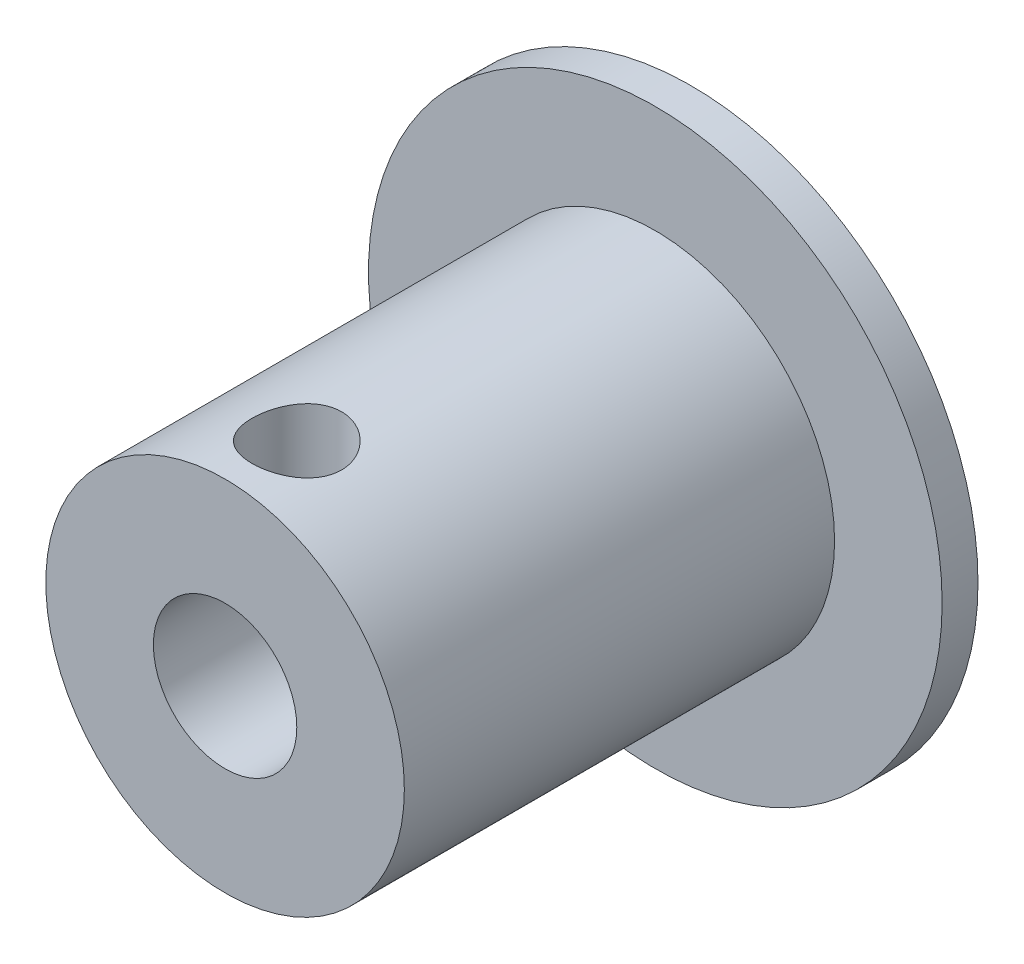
ISO-10303-21;
HEADER;
FILE_DESCRIPTION(('STEP AP214'),'2;1');
FILE_NAME('part.step','',(''),(''),'','','');
FILE_SCHEMA(('AUTOMOTIVE_DESIGN { 1 0 10303 214 1 1 1 1 }'));
ENDSEC;
DATA;
#1=APPLICATION_CONTEXT('core data for automotive mechanical design processes');
#2=APPLICATION_PROTOCOL_DEFINITION('international standard','automotive_design',2000,#1);
#3=PRODUCT_CONTEXT('',#1,'mechanical');
#4=PRODUCT('Part','Part','',(#3));
#5=PRODUCT_RELATED_PRODUCT_CATEGORY('part','',(#4));
#6=PRODUCT_DEFINITION_FORMATION('','',#4);
#7=PRODUCT_DEFINITION_CONTEXT('part definition',#1,'design');
#8=PRODUCT_DEFINITION('design','',#6,#7);
#9=PRODUCT_DEFINITION_SHAPE('','',#8);
#10=(LENGTH_UNIT() NAMED_UNIT(*) SI_UNIT(.MILLI.,.METRE.));
#11=(NAMED_UNIT(*) PLANE_ANGLE_UNIT() SI_UNIT($,.RADIAN.));
#12=(NAMED_UNIT(*) SI_UNIT($,.STERADIAN.) SOLID_ANGLE_UNIT());
#13=UNCERTAINTY_MEASURE_WITH_UNIT(LENGTH_MEASURE(1.E-05),#10,'distance_accuracy_value','');
#14=(GEOMETRIC_REPRESENTATION_CONTEXT(3) GLOBAL_UNCERTAINTY_ASSIGNED_CONTEXT((#13)) GLOBAL_UNIT_ASSIGNED_CONTEXT((#10,
#11,#12)) REPRESENTATION_CONTEXT('',''));
#15=CARTESIAN_POINT('',(0.,0.,0.));
#16=DIRECTION('',(0.,0.,1.));
#17=DIRECTION('',(1.,0.,0.));
#18=AXIS2_PLACEMENT_3D('',#15,#16,#17);
#19=CARTESIAN_POINT('',(0.,0.,1.));
#20=DIRECTION('',(0.,0.,-1.));
#21=DIRECTION('',(-1.,0.,0.));
#22=AXIS2_PLACEMENT_3D('',#19,#20,#21);
#23=CYLINDRICAL_SURFACE('',#22,8.);
#24=CARTESIAN_POINT('',(0.,0.,1.));
#25=DIRECTION('',(0.,0.,1.));
#26=DIRECTION('',(1.,0.,0.));
#27=AXIS2_PLACEMENT_3D('',#24,#25,#26);
#28=CIRCLE('',#27,8.);
#29=CARTESIAN_POINT('',(8.,0.,1.));
#30=VERTEX_POINT('',#29);
#31=EDGE_CURVE('E10',#30,#30,#28,.T.);
#32=ORIENTED_EDGE('',*,*,#31,.F.);
#33=EDGE_LOOP('',(#32));
#34=FACE_BOUND('',#33,.T.);
#35=CARTESIAN_POINT('',(0.,0.,0.));
#36=DIRECTION('',(0.,0.,1.));
#37=DIRECTION('',(1.,0.,0.));
#38=AXIS2_PLACEMENT_3D('',#35,#36,#37);
#39=CIRCLE('',#38,8.);
#40=CARTESIAN_POINT('',(8.,0.,0.));
#41=VERTEX_POINT('',#40);
#42=EDGE_CURVE('E37',#41,#41,#39,.T.);
#43=ORIENTED_EDGE('',*,*,#42,.T.);
#44=EDGE_LOOP('',(#43));
#45=FACE_BOUND('',#44,.T.);
#46=ADVANCED_FACE('F34',(#34,#45),#23,.T.);
#47=CARTESIAN_POINT('',(0.,0.,1.));
#48=DIRECTION('',(0.,0.,1.));
#49=DIRECTION('',(1.,0.,0.));
#50=AXIS2_PLACEMENT_3D('',#47,#48,#49);
#51=PLANE('',#50);
#52=CARTESIAN_POINT('',(0.,0.,1.));
#53=DIRECTION('',(0.,0.,1.));
#54=DIRECTION('',(1.,0.,0.));
#55=AXIS2_PLACEMENT_3D('',#52,#53,#54);
#56=CIRCLE('',#55,5.);
#57=CARTESIAN_POINT('',(5.,0.,1.));
#58=VERTEX_POINT('',#57);
#59=EDGE_CURVE('E46',#58,#58,#56,.T.);
#60=ORIENTED_EDGE('',*,*,#59,.F.);
#61=EDGE_LOOP('',(#60));
#62=FACE_BOUND('',#61,.T.);
#63=ORIENTED_EDGE('',*,*,#31,.T.);
#64=EDGE_LOOP('',(#63));
#65=FACE_BOUND('',#64,.T.);
#66=ADVANCED_FACE('F93',(#62,#65),#51,.T.);
#67=CARTESIAN_POINT('',(0.,0.,0.));
#68=DIRECTION('',(0.,0.,1.));
#69=DIRECTION('',(1.,0.,0.));
#70=AXIS2_PLACEMENT_3D('',#67,#68,#69);
#71=PLANE('',#70);
#72=CARTESIAN_POINT('',(0.,0.,0.));
#73=DIRECTION('',(0.,0.,-1.));
#74=DIRECTION('',(-1.,0.,0.));
#75=AXIS2_PLACEMENT_3D('',#72,#73,#74);
#76=CIRCLE('',#75,2.);
#77=CARTESIAN_POINT('',(-2.,0.,0.));
#78=VERTEX_POINT('',#77);
#79=EDGE_CURVE('E54',#78,#78,#76,.T.);
#80=ORIENTED_EDGE('',*,*,#79,.F.);
#81=EDGE_LOOP('',(#80));
#82=FACE_BOUND('',#81,.T.);
#83=ORIENTED_EDGE('',*,*,#42,.F.);
#84=EDGE_LOOP('',(#83));
#85=FACE_BOUND('',#84,.T.);
#86=ADVANCED_FACE('F88',(#82,#85),#71,.F.);
#87=CARTESIAN_POINT('',(0.,0.,13.));
#88=DIRECTION('',(0.,0.,-1.));
#89=DIRECTION('',(-1.,0.,0.));
#90=AXIS2_PLACEMENT_3D('',#87,#88,#89);
#91=CYLINDRICAL_SURFACE('',#90,5.);
#92=CARTESIAN_POINT('',(0.,5.,12.25));
#93=CARTESIAN_POINT('',(-0.0690634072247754,4.99999883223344,12.2499980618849));
#94=CARTESIAN_POINT('',(-0.138148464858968,4.99855481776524,12.2442570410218));
#95=CARTESIAN_POINT('',(-0.274338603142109,4.99293428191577,12.2214790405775));
#96=CARTESIAN_POINT('',(-0.341442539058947,4.98875621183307,12.2044356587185));
#97=CARTESIAN_POINT('',(-0.471684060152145,4.97813021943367,12.1596339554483));
#98=CARTESIAN_POINT('',(-0.534826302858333,4.97168502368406,12.1318885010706));
#99=CARTESIAN_POINT('',(-0.655560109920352,4.95721119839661,12.066515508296));
#100=CARTESIAN_POINT('',(-0.713151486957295,4.94918251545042,12.0288876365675));
#101=CARTESIAN_POINT('',(-0.822334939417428,4.93222844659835,11.9439993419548));
#102=CARTESIAN_POINT('',(-0.87379640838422,4.92328922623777,11.896573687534));
#103=CARTESIAN_POINT('',(-0.968124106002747,4.90561350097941,11.7937898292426));
#104=CARTESIAN_POINT('',(-1.01098936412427,4.89687701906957,11.7384307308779));
#105=CARTESIAN_POINT('',(-1.08752211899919,4.88045646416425,11.6203373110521));
#106=CARTESIAN_POINT('',(-1.12104351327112,4.87278995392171,11.5575056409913));
#107=CARTESIAN_POINT('',(-1.1769974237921,4.85957912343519,11.426876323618));
#108=CARTESIAN_POINT('',(-1.1994317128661,4.85403446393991,11.3590794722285));
#109=CARTESIAN_POINT('',(-1.23212903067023,4.84583730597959,11.2218804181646));
#110=CARTESIAN_POINT('',(-1.24262689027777,4.84312909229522,11.1525375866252));
#111=CARTESIAN_POINT('',(-1.25188481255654,4.84074468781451,11.0130261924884));
#112=CARTESIAN_POINT('',(-1.25064678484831,4.8410680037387,10.9428577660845));
#113=CARTESIAN_POINT('',(-1.23665543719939,4.84466004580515,10.8054868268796));
#114=CARTESIAN_POINT('',(-1.22418195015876,4.84785719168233,10.7382536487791));
#115=CARTESIAN_POINT('',(-1.18852015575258,4.85672258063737,10.6068657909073));
#116=CARTESIAN_POINT('',(-1.16533108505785,4.8623909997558,10.5427113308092));
#117=CARTESIAN_POINT('',(-1.10865789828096,4.87562594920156,10.4185516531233));
#118=CARTESIAN_POINT('',(-1.07507222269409,4.88321106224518,10.358594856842));
#119=CARTESIAN_POINT('',(-0.998630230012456,4.89941425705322,10.2450677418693));
#120=CARTESIAN_POINT('',(-0.955772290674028,4.90803251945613,10.1914985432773));
#121=CARTESIAN_POINT('',(-0.860552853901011,4.92563233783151,10.090663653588));
#122=CARTESIAN_POINT('',(-0.807955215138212,4.93461724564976,10.0436212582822));
#123=CARTESIAN_POINT('',(-0.69550993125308,4.95171637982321,9.95898229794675));
#124=CARTESIAN_POINT('',(-0.635662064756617,4.95983057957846,9.92138602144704));
#125=CARTESIAN_POINT('',(-0.510096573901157,4.97431443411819,9.85662451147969));
#126=CARTESIAN_POINT('',(-0.444359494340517,4.98067800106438,9.82949554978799));
#127=CARTESIAN_POINT('',(-0.309063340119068,4.99089930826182,9.78673557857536));
#128=CARTESIAN_POINT('',(-0.23950499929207,4.99475752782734,9.77110236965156));
#129=CARTESIAN_POINT('',(-0.100449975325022,4.99946249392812,9.75211869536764));
#130=CARTESIAN_POINT('',(-0.0309972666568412,5.00038377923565,9.74846414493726));
#131=CARTESIAN_POINT('',(0.107527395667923,4.99932337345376,9.75270750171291));
#132=CARTESIAN_POINT('',(0.176599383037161,4.99734194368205,9.76060436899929));
#133=CARTESIAN_POINT('',(0.311345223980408,4.99074650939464,9.78747575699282));
#134=CARTESIAN_POINT('',(0.377054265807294,4.98617195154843,9.80628438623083));
#135=CARTESIAN_POINT('',(0.504381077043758,4.97490588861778,9.85425590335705));
#136=CARTESIAN_POINT('',(0.565998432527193,4.9682141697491,9.88341983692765));
#137=CARTESIAN_POINT('',(0.684602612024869,4.95327756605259,9.95186344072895));
#138=CARTESIAN_POINT('',(0.741487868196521,4.94500722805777,9.99131342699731));
#139=CARTESIAN_POINT('',(0.847938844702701,4.92787090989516,10.0789915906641));
#140=CARTESIAN_POINT('',(0.897503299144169,4.91900482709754,10.1272212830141));
#141=CARTESIAN_POINT('',(0.98915880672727,4.90140797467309,10.2325016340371));
#142=CARTESIAN_POINT('',(1.03103655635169,4.89268586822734,10.289739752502));
#143=CARTESIAN_POINT('',(1.10459229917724,4.87660731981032,10.4106105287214));
#144=CARTESIAN_POINT('',(1.13627074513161,4.86925081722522,10.4742429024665));
#145=CARTESIAN_POINT('',(1.18829285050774,4.85681745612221,10.6057547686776));
#146=CARTESIAN_POINT('',(1.20870366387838,4.85172712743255,10.6736063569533));
#147=CARTESIAN_POINT('',(1.23778804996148,4.84438953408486,10.8119246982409));
#148=CARTESIAN_POINT('',(1.24646418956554,4.84214164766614,10.8823908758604));
#149=CARTESIAN_POINT('',(1.25169882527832,4.84079084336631,11.0217675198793));
#150=CARTESIAN_POINT('',(1.24859824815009,4.8415994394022,11.0906645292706));
#151=CARTESIAN_POINT('',(1.23114773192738,4.84606590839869,11.2269199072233));
#152=CARTESIAN_POINT('',(1.21679801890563,4.84972372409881,11.294278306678));
#153=CARTESIAN_POINT('',(1.17744276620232,4.85942717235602,11.4251737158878));
#154=CARTESIAN_POINT('',(1.15250117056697,4.86545846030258,11.4887310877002));
#155=CARTESIAN_POINT('',(1.09272076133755,4.87923129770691,11.6108044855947));
#156=CARTESIAN_POINT('',(1.05788057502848,4.88697308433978,11.6693198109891));
#157=CARTESIAN_POINT('',(0.978223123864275,4.90354695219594,11.7812955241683));
#158=CARTESIAN_POINT('',(0.933169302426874,4.91240220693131,11.8345842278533));
#159=CARTESIAN_POINT('',(0.834824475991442,4.93006689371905,11.9329558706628));
#160=CARTESIAN_POINT('',(0.781531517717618,4.93887631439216,11.9780368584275));
#161=CARTESIAN_POINT('',(0.667056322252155,4.95564713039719,12.0595094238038));
#162=CARTESIAN_POINT('',(0.605748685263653,4.9635902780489,12.0957288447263));
#163=CARTESIAN_POINT('',(0.477721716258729,4.97754104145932,12.1572895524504));
#164=CARTESIAN_POINT('',(0.411006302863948,4.98355004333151,12.1826386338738));
#165=CARTESIAN_POINT('',(0.287008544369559,4.99206716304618,12.2179765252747));
#166=CARTESIAN_POINT('',(0.230316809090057,4.99502154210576,12.2299593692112));
#167=CARTESIAN_POINT('',(0.115755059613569,4.9989883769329,12.2459716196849));
#168=CARTESIAN_POINT('',(0.0578851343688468,5.00000097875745,12.2500016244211));
#169=CARTESIAN_POINT('',(0.,5.,12.25));
#170=B_SPLINE_CURVE_WITH_KNOTS('',3,(#92,#93,#94,#95,#96,#97,#98,#99,#100,#101,#102,#103,#104,
#105,#106,#107,#108,#109,#110,#111,#112,#113,#114,#115,#116,#117,#118,#119,#120,#121,#122,#123,
#124,#125,#126,#127,#128,#129,#130,#131,#132,#133,#134,#135,#136,#137,#138,#139,#140,#141,#142,
#143,#144,#145,#146,#147,#148,#149,#150,#151,#152,#153,#154,#155,#156,#157,#158,#159,#160,#161,
#162,#163,#164,#165,#166,#167,#168,#169),.UNSPECIFIED.,.T.,.F.,(4,2,2,2,2,2,2,2,2,2,2,2,2,2,2,2,
2,2,2,2,2,2,2,2,2,2,2,2,2,2,2,2,2,2,2,2,2,2,4),(0.,0.206978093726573,0.414073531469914,
0.620920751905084,0.827774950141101,1.03845362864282,1.24915607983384,1.46298872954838,
1.67678717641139,1.88630245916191,2.09578365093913,2.30018747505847,2.50460586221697,
2.71108773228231,2.917605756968,3.13001250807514,3.3424257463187,3.55556857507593,
3.768670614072,3.97631924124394,4.1839491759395,4.38850228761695,4.59307606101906,
4.8012798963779,5.00951969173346,5.22287091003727,5.43621265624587,5.64826878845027,
5.86027852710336,6.0661981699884,6.27211367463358,6.47680333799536,6.6815214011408,
6.89157980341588,7.1016880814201,7.31560154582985,7.52936136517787,7.70285202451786,
7.87632963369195),.UNSPECIFIED.);
#171=CARTESIAN_POINT('',(0.,5.,12.25));
#172=VERTEX_POINT('',#171);
#173=EDGE_CURVE('E57',#172,#172,#170,.T.);
#174=ORIENTED_EDGE('',*,*,#173,.T.);
#175=EDGE_LOOP('',(#174));
#176=FACE_BOUND('',#175,.T.);
#177=CARTESIAN_POINT('',(0.,0.,13.));
#178=DIRECTION('',(0.,0.,1.));
#179=DIRECTION('',(1.,0.,0.));
#180=AXIS2_PLACEMENT_3D('',#177,#178,#179);
#181=CIRCLE('',#180,5.);
#182=CARTESIAN_POINT('',(5.,0.,13.));
#183=VERTEX_POINT('',#182);
#184=EDGE_CURVE('E44',#183,#183,#181,.T.);
#185=ORIENTED_EDGE('',*,*,#184,.F.);
#186=EDGE_LOOP('',(#185));
#187=FACE_BOUND('',#186,.T.);
#188=ORIENTED_EDGE('',*,*,#59,.T.);
#189=EDGE_LOOP('',(#188));
#190=FACE_BOUND('',#189,.T.);
#191=ADVANCED_FACE('F68',(#176,#187,#190),#91,.T.);
#192=CARTESIAN_POINT('',(0.,0.,13.));
#193=DIRECTION('',(0.,0.,1.));
#194=DIRECTION('',(1.,0.,0.));
#195=AXIS2_PLACEMENT_3D('',#192,#193,#194);
#196=PLANE('',#195);
#197=CARTESIAN_POINT('',(0.,0.,13.));
#198=DIRECTION('',(0.,0.,1.));
#199=DIRECTION('',(1.,0.,0.));
#200=AXIS2_PLACEMENT_3D('',#197,#198,#199);
#201=CIRCLE('',#200,2.);
#202=CARTESIAN_POINT('',(2.,0.,13.));
#203=VERTEX_POINT('',#202);
#204=EDGE_CURVE('E49',#203,#203,#201,.T.);
#205=ORIENTED_EDGE('',*,*,#204,.F.);
#206=EDGE_LOOP('',(#205));
#207=FACE_BOUND('',#206,.T.);
#208=ORIENTED_EDGE('',*,*,#184,.T.);
#209=EDGE_LOOP('',(#208));
#210=FACE_BOUND('',#209,.T.);
#211=ADVANCED_FACE('F81',(#207,#210),#196,.T.);
#212=CARTESIAN_POINT('',(0.,0.,0.));
#213=DIRECTION('',(0.,0.,-1.));
#214=DIRECTION('',(-1.,0.,0.));
#215=AXIS2_PLACEMENT_3D('',#212,#213,#214);
#216=CYLINDRICAL_SURFACE('',#215,2.);
#217=CARTESIAN_POINT('',(0.,2.,12.25));
#218=CARTESIAN_POINT('',(0.0635104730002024,1.99999595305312,12.2499956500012));
#219=CARTESIAN_POINT('',(0.127096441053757,1.99694323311,12.2451269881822));
#220=CARTESIAN_POINT('',(0.252318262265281,1.98502167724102,12.2259141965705));
#221=CARTESIAN_POINT('',(0.313950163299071,1.97614175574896,12.2115520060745));
#222=CARTESIAN_POINT('',(0.43320555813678,1.95345852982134,12.1741886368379));
#223=CARTESIAN_POINT('',(0.490847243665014,1.93967960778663,12.1512302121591));
#224=CARTESIAN_POINT('',(0.601260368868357,1.90834598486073,12.0976141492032));
#225=CARTESIAN_POINT('',(0.654032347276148,1.89079170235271,12.0669573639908));
#226=CARTESIAN_POINT('',(0.757974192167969,1.85170152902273,11.996113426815));
#227=CARTESIAN_POINT('',(0.808679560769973,1.82995962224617,11.9553607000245));
#228=CARTESIAN_POINT('',(0.902986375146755,1.78531349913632,11.8667808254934));
#229=CARTESIAN_POINT('',(0.946578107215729,1.76240774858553,11.8189441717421));
#230=CARTESIAN_POINT('',(1.03142873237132,1.71430418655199,11.7099661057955));
#231=CARTESIAN_POINT('',(1.0715720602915,1.68921610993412,11.6479002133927));
#232=CARTESIAN_POINT('',(1.14073966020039,1.64330198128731,11.5164351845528));
#233=CARTESIAN_POINT('',(1.16978270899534,1.62246875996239,11.4470486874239));
#234=CARTESIAN_POINT('',(1.2093340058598,1.59309575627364,11.3211894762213));
#235=CARTESIAN_POINT('',(1.22269552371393,1.58276905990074,11.2660331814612));
#236=CARTESIAN_POINT('',(1.24181843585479,1.56781357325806,11.1536940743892));
#237=CARTESIAN_POINT('',(1.24759056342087,1.56317673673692,11.0965142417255));
#238=CARTESIAN_POINT('',(1.25118918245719,1.56029885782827,10.9815869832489));
#239=CARTESIAN_POINT('',(1.2489948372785,1.56207458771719,10.9238384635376));
#240=CARTESIAN_POINT('',(1.23676317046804,1.5717740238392,10.809689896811));
#241=CARTESIAN_POINT('',(1.22671956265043,1.5797026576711,10.7532909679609));
#242=CARTESIAN_POINT('',(1.19968103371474,1.60032573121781,10.6445615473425));
#243=CARTESIAN_POINT('',(1.18285016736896,1.61290715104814,10.5921675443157));
#244=CARTESIAN_POINT('',(1.14290189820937,1.64145566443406,10.4908388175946));
#245=CARTESIAN_POINT('',(1.11978227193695,1.65742395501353,10.4419053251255));
#246=CARTESIAN_POINT('',(1.06294892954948,1.6945481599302,10.3391667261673));
#247=CARTESIAN_POINT('',(1.0280629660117,1.71611591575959,10.2861591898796));
#248=CARTESIAN_POINT('',(0.950881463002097,1.76005711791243,10.1861697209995));
#249=CARTESIAN_POINT('',(0.908578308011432,1.78243137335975,10.1391940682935));
#250=CARTESIAN_POINT('',(0.809519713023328,1.82979894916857,10.0446982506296));
#251=CARTESIAN_POINT('',(0.75153135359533,1.85461531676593,9.99836702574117));
#252=CARTESIAN_POINT('',(0.627148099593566,1.90028055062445,9.91614910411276));
#253=CARTESIAN_POINT('',(0.560756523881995,1.92113097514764,9.88025830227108));
#254=CARTESIAN_POINT('',(0.424883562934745,1.95553372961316,9.82223631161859));
#255=CARTESIAN_POINT('',(0.355763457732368,1.96941976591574,9.79946596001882));
#256=CARTESIAN_POINT('',(0.213612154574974,1.98984929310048,9.76623507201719));
#257=CARTESIAN_POINT('',(0.140586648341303,1.9964031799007,9.755757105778));
#258=CARTESIAN_POINT('',(0.00451561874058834,2.00097840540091,9.74843414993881));
#259=CARTESIAN_POINT('',(-0.0584027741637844,2.0001216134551,9.74979682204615));
#260=CARTESIAN_POINT('',(-0.182972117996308,1.99258901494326,9.76188282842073));
#261=CARTESIAN_POINT('',(-0.244623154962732,1.98591360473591,9.77260552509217));
#262=CARTESIAN_POINT('',(-0.362521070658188,1.96774052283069,9.80223853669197));
#263=CARTESIAN_POINT('',(-0.418885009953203,1.95644170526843,9.82081215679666));
#264=CARTESIAN_POINT('',(-0.527638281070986,1.92995684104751,9.86529638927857));
#265=CARTESIAN_POINT('',(-0.580026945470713,1.91477014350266,9.89120823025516));
#266=CARTESIAN_POINT('',(-0.685084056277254,1.87990012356,9.95251520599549));
#267=CARTESIAN_POINT('',(-0.737246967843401,1.85991764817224,9.98860356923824));
#268=CARTESIAN_POINT('',(-0.835142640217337,1.81806970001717,10.0677938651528));
#269=CARTESIAN_POINT('',(-0.88086815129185,1.79620214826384,10.1109035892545));
#270=CARTESIAN_POINT('',(-0.971474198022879,1.74905869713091,10.2101350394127));
#271=CARTESIAN_POINT('',(-1.01526851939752,1.72374883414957,10.2672372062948));
#272=CARTESIAN_POINT('',(-1.09280351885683,1.67566762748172,10.3888757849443));
#273=CARTESIAN_POINT('',(-1.12655115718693,1.65289453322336,10.453407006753));
#274=CARTESIAN_POINT('',(-1.17684772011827,1.61733530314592,10.5746921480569));
#275=CARTESIAN_POINT('',(-1.19551895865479,1.6034563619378,10.6302407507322));
#276=CARTESIAN_POINT('',(-1.22500108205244,1.58105030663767,10.7443931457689));
#277=CARTESIAN_POINT('',(-1.23582424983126,1.57251483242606,10.8029920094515));
#278=CARTESIAN_POINT('',(-1.24901383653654,1.56206324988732,10.9220902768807));
#279=CARTESIAN_POINT('',(-1.25133186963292,1.56018501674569,10.9825985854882));
#280=CARTESIAN_POINT('',(-1.24719778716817,1.56349063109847,11.103130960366));
#281=CARTESIAN_POINT('',(-1.24074275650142,1.56867682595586,11.1631548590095));
#282=CARTESIAN_POINT('',(-1.22038272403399,1.58455388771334,11.2760297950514));
#283=CARTESIAN_POINT('',(-1.20711919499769,1.5947680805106,11.3290693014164));
#284=CARTESIAN_POINT('',(-1.17417623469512,1.6191753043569,11.4321350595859));
#285=CARTESIAN_POINT('',(-1.15449412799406,1.63336999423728,11.4821600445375));
#286=CARTESIAN_POINT('',(-1.10602690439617,1.66663902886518,11.5855967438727));
#287=CARTESIAN_POINT('',(-1.07633644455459,1.68612230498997,11.6384502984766));
#288=CARTESIAN_POINT('',(-1.01000017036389,1.72667706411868,11.738938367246));
#289=CARTESIAN_POINT('',(-0.973348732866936,1.74774982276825,11.7865686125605));
#290=CARTESIAN_POINT('',(-0.885670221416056,1.79401910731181,11.8850142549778));
#291=CARTESIAN_POINT('',(-0.833233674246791,1.81920541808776,11.9345908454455));
#292=CARTESIAN_POINT('',(-0.7198224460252,1.86698729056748,12.0244948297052));
#293=CARTESIAN_POINT('',(-0.658842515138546,1.88958124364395,12.0648164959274));
#294=CARTESIAN_POINT('',(-0.529355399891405,1.92986710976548,12.1347711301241));
#295=CARTESIAN_POINT('',(-0.460835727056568,1.94755071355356,12.1643860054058));
#296=CARTESIAN_POINT('',(-0.318394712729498,1.97581521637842,12.2110718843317));
#297=CARTESIAN_POINT('',(-0.244493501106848,1.98642121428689,12.2281872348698));
#298=CARTESIAN_POINT('',(-0.141418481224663,1.99519472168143,12.2422992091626));
#299=CARTESIAN_POINT('',(-0.113248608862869,1.99699172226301,12.245181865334));
#300=CARTESIAN_POINT('',(-0.0567241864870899,1.99939530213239,12.2490332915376));
#301=CARTESIAN_POINT('',(-0.0283696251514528,2.0000018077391,12.25000194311));
#302=CARTESIAN_POINT('',(0.,2.,12.25));
#303=B_SPLINE_CURVE_WITH_KNOTS('',3,(#217,#218,#219,#220,#221,#222,#223,#224,#225,#226,#227,
#228,#229,#230,#231,#232,#233,#234,#235,#236,#237,#238,#239,#240,#241,#242,#243,#244,#245,#246,
#247,#248,#249,#250,#251,#252,#253,#254,#255,#256,#257,#258,#259,#260,#261,#262,#263,#264,#265,
#266,#267,#268,#269,#270,#271,#272,#273,#274,#275,#276,#277,#278,#279,#280,#281,#282,#283,#284,
#285,#286,#287,#288,#289,#290,#291,#292,#293,#294,#295,#296,#297,#298,#299,#300,#301,#302),
.UNSPECIFIED.,.T.,.F.,(4,2,2,2,2,2,2,2,2,2,2,2,2,2,2,2,2,2,2,2,2,2,2,2,2,2,2,2,2,2,2,2,2,2,2,2,
2,2,2,2,2,2,4),(0.,0.190412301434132,0.381187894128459,0.571026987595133,0.760845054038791,
0.965821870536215,1.17107628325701,1.40412975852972,1.63678724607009,1.80912008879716,
1.9812089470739,2.15374823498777,2.32642584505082,2.49515839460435,2.66395067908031,
2.86427450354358,3.0648052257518,3.2984218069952,3.53194640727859,3.75284174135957,
3.97342347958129,4.16127180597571,4.34910733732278,4.52959504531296,4.71011298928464,
4.9088523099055,5.10781368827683,5.3356570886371,5.56334227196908,5.74329940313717,
5.92297427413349,6.10366974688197,6.28442527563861,6.45063169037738,6.61690747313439,
6.80725523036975,6.99775741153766,7.22600539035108,7.45439424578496,7.68316725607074,
7.91112460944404,7.99617501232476,8.08123067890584),.UNSPECIFIED.);
#304=CARTESIAN_POINT('',(0.,2.,12.25));
#305=VERTEX_POINT('',#304);
#306=EDGE_CURVE('E64',#305,#305,#303,.T.);
#307=ORIENTED_EDGE('',*,*,#306,.T.);
#308=EDGE_LOOP('',(#307));
#309=FACE_BOUND('',#308,.T.);
#310=ORIENTED_EDGE('',*,*,#79,.T.);
#311=EDGE_LOOP('',(#310));
#312=FACE_BOUND('',#311,.T.);
#313=ORIENTED_EDGE('',*,*,#204,.T.);
#314=EDGE_LOOP('',(#313));
#315=FACE_BOUND('',#314,.T.);
#316=ADVANCED_FACE('F75',(#309,#312,#315),#216,.F.);
#317=CARTESIAN_POINT('',(0.,5.,11.));
#318=DIRECTION('',(0.,1.,0.));
#319=DIRECTION('',(0.,0.,1.));
#320=AXIS2_PLACEMENT_3D('',#317,#318,#319);
#321=CYLINDRICAL_SURFACE('',#320,1.24999999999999);
#322=ORIENTED_EDGE('',*,*,#306,.F.);
#323=EDGE_LOOP('',(#322));
#324=FACE_BOUND('',#323,.T.);
#325=ORIENTED_EDGE('',*,*,#173,.F.);
#326=EDGE_LOOP('',(#325));
#327=FACE_BOUND('',#326,.T.);
#328=ADVANCED_FACE('F72',(#324,#327),#321,.F.);
#329=CLOSED_SHELL('',(#46,#66,#86,#191,#211,#316,#328));
#330=MANIFOLD_SOLID_BREP('B2',#329);
#331=ADVANCED_BREP_SHAPE_REPRESENTATION('',(#18,#330),#14);
#332=SHAPE_DEFINITION_REPRESENTATION(#9,#331);
ENDSEC;
END-ISO-10303-21;
